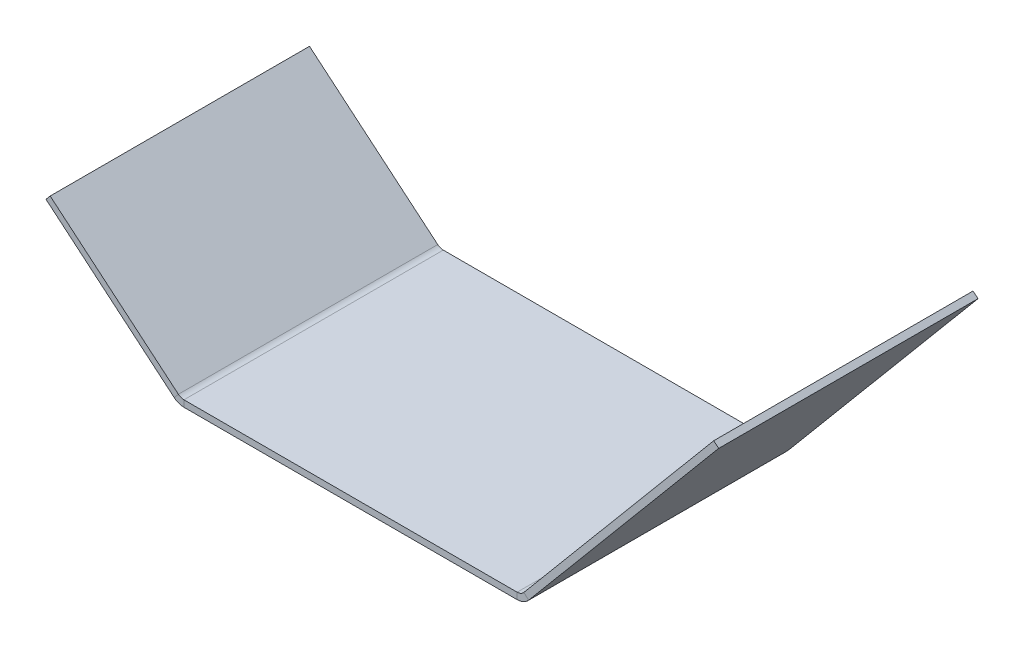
ISO-10303-21;
HEADER;
FILE_DESCRIPTION(('STEP AP214'),'2;1');
FILE_NAME('part.step','',(''),(''),'','','');
FILE_SCHEMA(('AUTOMOTIVE_DESIGN { 1 0 10303 214 1 1 1 1 }'));
ENDSEC;
DATA;
#1=APPLICATION_CONTEXT('core data for automotive mechanical design processes');
#2=APPLICATION_PROTOCOL_DEFINITION('international standard','automotive_design',2000,#1);
#3=PRODUCT_CONTEXT('',#1,'mechanical');
#4=PRODUCT('Part','Part','',(#3));
#5=PRODUCT_RELATED_PRODUCT_CATEGORY('part','',(#4));
#6=PRODUCT_DEFINITION_FORMATION('','',#4);
#7=PRODUCT_DEFINITION_CONTEXT('part definition',#1,'design');
#8=PRODUCT_DEFINITION('design','',#6,#7);
#9=PRODUCT_DEFINITION_SHAPE('','',#8);
#10=(LENGTH_UNIT() NAMED_UNIT(*) SI_UNIT(.MILLI.,.METRE.));
#11=(NAMED_UNIT(*) PLANE_ANGLE_UNIT() SI_UNIT($,.RADIAN.));
#12=(NAMED_UNIT(*) SI_UNIT($,.STERADIAN.) SOLID_ANGLE_UNIT());
#13=UNCERTAINTY_MEASURE_WITH_UNIT(LENGTH_MEASURE(1.E-05),#10,'distance_accuracy_value','');
#14=(GEOMETRIC_REPRESENTATION_CONTEXT(3) GLOBAL_UNCERTAINTY_ASSIGNED_CONTEXT((#13)) GLOBAL_UNIT_ASSIGNED_CONTEXT((#10,
#11,#12)) REPRESENTATION_CONTEXT('',''));
#15=CARTESIAN_POINT('',(0.,0.,0.));
#16=DIRECTION('',(0.,0.,1.));
#17=DIRECTION('',(1.,0.,0.));
#18=AXIS2_PLACEMENT_3D('',#15,#16,#17);
#19=CARTESIAN_POINT('',(-0.975860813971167,0.818844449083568,60.));
#20=DIRECTION('',(0.,0.,1.));
#21=DIRECTION('',(1.,0.,0.));
#22=AXIS2_PLACEMENT_3D('',#19,#20,#21);
#23=PLANE('',#22);
#24=DIRECTION('',(0.642787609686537,0.76604444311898,0.));
#25=VECTOR('',#24,1.);
#26=CARTESIAN_POINT('',(-0.975860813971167,0.818844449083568,60.));
#27=LINE('',#26,#25);
#28=CARTESIAN_POINT('',(-0.975860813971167,0.818844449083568,60.));
#29=VERTEX_POINT('',#28);
#30=CARTESIAN_POINT('',(-0.0116793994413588,1.96791111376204,60.));
#31=VERTEX_POINT('',#30);
#32=EDGE_CURVE('E11',#29,#31,#27,.T.);
#33=ORIENTED_EDGE('',*,*,#32,.F.);
#34=CARTESIAN_POINT('',(1.27389581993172,3.5,60.));
#35=DIRECTION('',(0.,0.,-1.));
#36=DIRECTION('',(-1.,0.,0.));
#37=AXIS2_PLACEMENT_3D('',#34,#35,#36);
#38=CIRCLE('',#37,3.5);
#39=CARTESIAN_POINT('',(1.27389581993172,0.,60.));
#40=VERTEX_POINT('',#39);
#41=EDGE_CURVE('E147',#29,#40,#38,.F.);
#42=ORIENTED_EDGE('',*,*,#41,.T.);
#43=DIRECTION('',(0.,-1.,0.));
#44=VECTOR('',#43,1.);
#45=CARTESIAN_POINT('',(1.27389581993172,1.5,60.));
#46=LINE('',#45,#44);
#47=CARTESIAN_POINT('',(1.27389581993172,1.5,60.));
#48=VERTEX_POINT('',#47);
#49=EDGE_CURVE('E45',#48,#40,#46,.T.);
#50=ORIENTED_EDGE('',*,*,#49,.F.);
#51=CARTESIAN_POINT('',(1.27389581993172,3.5,60.));
#52=DIRECTION('',(0.,0.,1.));
#53=DIRECTION('',(1.,0.,0.));
#54=AXIS2_PLACEMENT_3D('',#51,#52,#53);
#55=CIRCLE('',#54,2.);
#56=EDGE_CURVE('E241',#31,#48,#55,.T.);
#57=ORIENTED_EDGE('',*,*,#56,.F.);
#58=EDGE_LOOP('',(#33,#42,#50,#57));
#59=FACE_BOUND('',#58,.T.);
#60=ADVANCED_FACE('F37',(#59),#23,.T.);
#61=CARTESIAN_POINT('',(1.27389581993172,1.5,60.));
#62=DIRECTION('',(0.,0.,1.));
#63=DIRECTION('',(1.,0.,0.));
#64=AXIS2_PLACEMENT_3D('',#61,#62,#63);
#65=PLANE('',#64);
#66=DIRECTION('',(0.766044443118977,-0.64278760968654,0.));
#67=VECTOR('',#66,1.);
#68=CARTESIAN_POINT('',(-30.6417777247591,25.7115043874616,60.));
#69=LINE('',#68,#67);
#70=CARTESIAN_POINT('',(-30.6417777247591,25.7115043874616,60.));
#71=VERTEX_POINT('',#70);
#72=EDGE_CURVE('E152',#71,#29,#69,.T.);
#73=ORIENTED_EDGE('',*,*,#72,.T.);
#74=ORIENTED_EDGE('',*,*,#32,.T.);
#75=DIRECTION('',(0.766044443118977,-0.64278760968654,0.));
#76=VECTOR('',#75,1.);
#77=CARTESIAN_POINT('',(-29.6775963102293,26.8605710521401,60.));
#78=LINE('',#77,#76);
#79=CARTESIAN_POINT('',(-29.6775963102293,26.8605710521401,60.));
#80=VERTEX_POINT('',#79);
#81=EDGE_CURVE('E254',#80,#31,#78,.T.);
#82=ORIENTED_EDGE('',*,*,#81,.F.);
#83=DIRECTION('',(0.642787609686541,0.766044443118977,0.));
#84=VECTOR('',#83,1.);
#85=CARTESIAN_POINT('',(-30.6417777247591,25.7115043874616,60.));
#86=LINE('',#85,#84);
#87=EDGE_CURVE('E256',#71,#80,#86,.T.);
#88=ORIENTED_EDGE('',*,*,#87,.F.);
#89=EDGE_LOOP('',(#73,#74,#82,#88));
#90=FACE_BOUND('',#89,.T.);
#91=ADVANCED_FACE('F267',(#90),#65,.T.);
#92=CARTESIAN_POINT('',(1.27389581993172,0.,0.));
#93=DIRECTION('',(0.,0.,-1.));
#94=DIRECTION('',(-1.,0.,0.));
#95=AXIS2_PLACEMENT_3D('',#92,#93,#94);
#96=PLANE('',#95);
#97=DIRECTION('',(0.,1.,0.));
#98=VECTOR('',#97,1.);
#99=CARTESIAN_POINT('',(1.27389581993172,0.,0.));
#100=LINE('',#99,#98);
#101=CARTESIAN_POINT('',(1.27389581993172,0.,0.));
#102=VERTEX_POINT('',#101);
#103=CARTESIAN_POINT('',(1.27389581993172,1.5,0.));
#104=VERTEX_POINT('',#103);
#105=EDGE_CURVE('E145',#102,#104,#100,.T.);
#106=ORIENTED_EDGE('',*,*,#105,.F.);
#107=CARTESIAN_POINT('',(1.27389581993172,3.5,0.));
#108=DIRECTION('',(0.,0.,-1.));
#109=DIRECTION('',(-1.,0.,0.));
#110=AXIS2_PLACEMENT_3D('',#107,#108,#109);
#111=CIRCLE('',#110,3.5);
#112=CARTESIAN_POINT('',(-0.975860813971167,0.818844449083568,0.));
#113=VERTEX_POINT('',#112);
#114=EDGE_CURVE('E159',#113,#102,#111,.F.);
#115=ORIENTED_EDGE('',*,*,#114,.F.);
#116=DIRECTION('',(-0.642787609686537,-0.76604444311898,0.));
#117=VECTOR('',#116,1.);
#118=CARTESIAN_POINT('',(-0.0116793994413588,1.96791111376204,0.));
#119=LINE('',#118,#117);
#120=CARTESIAN_POINT('',(-0.0116793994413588,1.96791111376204,0.));
#121=VERTEX_POINT('',#120);
#122=EDGE_CURVE('E232',#121,#113,#119,.T.);
#123=ORIENTED_EDGE('',*,*,#122,.F.);
#124=CARTESIAN_POINT('',(1.27389581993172,3.5,0.));
#125=DIRECTION('',(0.,0.,1.));
#126=DIRECTION('',(1.,0.,0.));
#127=AXIS2_PLACEMENT_3D('',#124,#125,#126);
#128=CIRCLE('',#127,2.);
#129=EDGE_CURVE('E186',#121,#104,#128,.T.);
#130=ORIENTED_EDGE('',*,*,#129,.T.);
#131=EDGE_LOOP('',(#106,#115,#123,#130));
#132=FACE_BOUND('',#131,.T.);
#133=ADVANCED_FACE('F246',(#132),#96,.T.);
#134=CARTESIAN_POINT('',(-0.0116793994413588,1.96791111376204,0.));
#135=DIRECTION('',(0.,0.,-1.));
#136=DIRECTION('',(-1.,0.,0.));
#137=AXIS2_PLACEMENT_3D('',#134,#135,#136);
#138=PLANE('',#137);
#139=DIRECTION('',(1.,0.,0.));
#140=VECTOR('',#139,1.);
#141=CARTESIAN_POINT('',(0.,0.,0.));
#142=LINE('',#141,#140);
#143=CARTESIAN_POINT('',(78.3679231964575,0.,0.));
#144=VERTEX_POINT('',#143);
#145=EDGE_CURVE('E199',#102,#144,#142,.T.);
#146=ORIENTED_EDGE('',*,*,#145,.F.);
#147=ORIENTED_EDGE('',*,*,#105,.T.);
#148=DIRECTION('',(1.,0.,0.));
#149=VECTOR('',#148,1.);
#150=CARTESIAN_POINT('',(0.,1.5,0.));
#151=LINE('',#150,#149);
#152=CARTESIAN_POINT('',(78.3679231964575,1.5,0.));
#153=VERTEX_POINT('',#152);
#154=EDGE_CURVE('E184',#104,#153,#151,.T.);
#155=ORIENTED_EDGE('',*,*,#154,.T.);
#156=DIRECTION('',(0.,-1.,0.));
#157=VECTOR('',#156,1.);
#158=CARTESIAN_POINT('',(78.3679231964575,1.5,0.));
#159=LINE('',#158,#157);
#160=EDGE_CURVE('E94',#153,#144,#159,.T.);
#161=ORIENTED_EDGE('',*,*,#160,.T.);
#162=EDGE_LOOP('',(#146,#147,#155,#161));
#163=FACE_BOUND('',#162,.T.);
#164=ADVANCED_FACE('F234',(#163),#138,.T.);
#165=CARTESIAN_POINT('',(78.3679231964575,0.,60.));
#166=DIRECTION('',(0.,0.,1.));
#167=DIRECTION('',(1.,0.,0.));
#168=AXIS2_PLACEMENT_3D('',#165,#166,#167);
#169=PLANE('',#168);
#170=DIRECTION('',(0.,1.,0.));
#171=VECTOR('',#170,1.);
#172=CARTESIAN_POINT('',(78.3679231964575,0.,60.));
#173=LINE('',#172,#171);
#174=CARTESIAN_POINT('',(78.3679231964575,0.,60.));
#175=VERTEX_POINT('',#174);
#176=CARTESIAN_POINT('',(78.3679231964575,1.5,60.));
#177=VERTEX_POINT('',#176);
#178=EDGE_CURVE('E230',#175,#177,#173,.T.);
#179=ORIENTED_EDGE('',*,*,#178,.F.);
#180=CARTESIAN_POINT('',(78.3679231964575,3.5,60.));
#181=DIRECTION('',(0.,0.,-1.));
#182=DIRECTION('',(-1.,0.,0.));
#183=AXIS2_PLACEMENT_3D('',#180,#181,#182);
#184=CIRCLE('',#183,3.5);
#185=CARTESIAN_POINT('',(81.0490787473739,1.25024336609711,60.));
#186=VERTEX_POINT('',#185);
#187=EDGE_CURVE('E167',#175,#186,#184,.F.);
#188=ORIENTED_EDGE('',*,*,#187,.T.);
#189=DIRECTION('',(0.766044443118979,-0.642787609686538,0.));
#190=VECTOR('',#189,1.);
#191=CARTESIAN_POINT('',(79.9000120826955,2.21442478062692,60.));
#192=LINE('',#191,#190);
#193=CARTESIAN_POINT('',(79.9000120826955,2.21442478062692,60.));
#194=VERTEX_POINT('',#193);
#195=EDGE_CURVE('E53',#194,#186,#192,.T.);
#196=ORIENTED_EDGE('',*,*,#195,.F.);
#197=CARTESIAN_POINT('',(78.3679231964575,3.5,60.));
#198=DIRECTION('',(0.,0.,1.));
#199=DIRECTION('',(1.,0.,0.));
#200=AXIS2_PLACEMENT_3D('',#197,#198,#199);
#201=CIRCLE('',#200,2.);
#202=EDGE_CURVE('E258',#177,#194,#201,.T.);
#203=ORIENTED_EDGE('',*,*,#202,.F.);
#204=EDGE_LOOP('',(#179,#188,#196,#203));
#205=FACE_BOUND('',#204,.T.);
#206=ADVANCED_FACE('F293',(#205),#169,.T.);
#207=CARTESIAN_POINT('',(79.9000120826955,2.21442478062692,60.));
#208=DIRECTION('',(0.,0.,1.));
#209=DIRECTION('',(1.,0.,0.));
#210=AXIS2_PLACEMENT_3D('',#207,#208,#209);
#211=PLANE('',#210);
#212=DIRECTION('',(1.,0.,0.));
#213=VECTOR('',#212,1.);
#214=CARTESIAN_POINT('',(0.,0.,60.));
#215=LINE('',#214,#213);
#216=EDGE_CURVE('E137',#40,#175,#215,.T.);
#217=ORIENTED_EDGE('',*,*,#216,.T.);
#218=ORIENTED_EDGE('',*,*,#178,.T.);
#219=DIRECTION('',(1.,0.,0.));
#220=VECTOR('',#219,1.);
#221=CARTESIAN_POINT('',(0.,1.5,60.));
#222=LINE('',#221,#220);
#223=EDGE_CURVE('E140',#48,#177,#222,.T.);
#224=ORIENTED_EDGE('',*,*,#223,.F.);
#225=ORIENTED_EDGE('',*,*,#49,.T.);
#226=EDGE_LOOP('',(#217,#218,#224,#225));
#227=FACE_BOUND('',#226,.T.);
#228=ADVANCED_FACE('F135',(#227),#211,.T.);
#229=CARTESIAN_POINT('',(81.0490787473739,1.25024336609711,0.));
#230=DIRECTION('',(0.,0.,-1.));
#231=DIRECTION('',(-1.,0.,0.));
#232=AXIS2_PLACEMENT_3D('',#229,#230,#231);
#233=PLANE('',#232);
#234=DIRECTION('',(-0.766044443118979,0.642787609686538,0.));
#235=VECTOR('',#234,1.);
#236=CARTESIAN_POINT('',(81.0490787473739,1.25024336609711,0.));
#237=LINE('',#236,#235);
#238=CARTESIAN_POINT('',(81.0490787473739,1.25024336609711,0.));
#239=VERTEX_POINT('',#238);
#240=CARTESIAN_POINT('',(79.9000120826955,2.21442478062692,0.));
#241=VERTEX_POINT('',#240);
#242=EDGE_CURVE('E101',#239,#241,#237,.T.);
#243=ORIENTED_EDGE('',*,*,#242,.F.);
#244=CARTESIAN_POINT('',(78.3679231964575,3.5,0.));
#245=DIRECTION('',(0.,0.,-1.));
#246=DIRECTION('',(-1.,0.,0.));
#247=AXIS2_PLACEMENT_3D('',#244,#245,#246);
#248=CIRCLE('',#247,3.5);
#249=EDGE_CURVE('E201',#144,#239,#248,.F.);
#250=ORIENTED_EDGE('',*,*,#249,.F.);
#251=ORIENTED_EDGE('',*,*,#160,.F.);
#252=CARTESIAN_POINT('',(78.3679231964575,3.5,0.));
#253=DIRECTION('',(0.,0.,1.));
#254=DIRECTION('',(1.,0.,0.));
#255=AXIS2_PLACEMENT_3D('',#252,#253,#254);
#256=CIRCLE('',#255,2.);
#257=EDGE_CURVE('E182',#153,#241,#256,.T.);
#258=ORIENTED_EDGE('',*,*,#257,.T.);
#259=EDGE_LOOP('',(#243,#250,#251,#258));
#260=FACE_BOUND('',#259,.T.);
#261=ADVANCED_FACE('F299',(#260),#233,.T.);
#262=CARTESIAN_POINT('',(78.3679231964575,1.5,0.));
#263=DIRECTION('',(0.,0.,-1.));
#264=DIRECTION('',(-1.,0.,0.));
#265=AXIS2_PLACEMENT_3D('',#262,#263,#264);
#266=PLANE('',#265);
#267=DIRECTION('',(0.642787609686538,0.766044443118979,0.));
#268=VECTOR('',#267,1.);
#269=CARTESIAN_POINT('',(80.,0.,0.));
#270=LINE('',#269,#268);
#271=CARTESIAN_POINT('',(124.995132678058,53.6231110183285,0.));
#272=VERTEX_POINT('',#271);
#273=EDGE_CURVE('E173',#239,#272,#270,.T.);
#274=ORIENTED_EDGE('',*,*,#273,.F.);
#275=ORIENTED_EDGE('',*,*,#242,.T.);
#276=DIRECTION('',(0.642787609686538,0.766044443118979,0.));
#277=VECTOR('',#276,1.);
#278=CARTESIAN_POINT('',(78.8509333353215,0.964181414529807,0.));
#279=LINE('',#278,#277);
#280=CARTESIAN_POINT('',(123.846066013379,54.5872924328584,0.));
#281=VERTEX_POINT('',#280);
#282=EDGE_CURVE('E179',#241,#281,#279,.T.);
#283=ORIENTED_EDGE('',*,*,#282,.T.);
#284=DIRECTION('',(0.766044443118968,-0.642787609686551,0.));
#285=VECTOR('',#284,1.);
#286=CARTESIAN_POINT('',(123.846066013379,54.5872924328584,0.));
#287=LINE('',#286,#285);
#288=EDGE_CURVE('E176',#281,#272,#287,.T.);
#289=ORIENTED_EDGE('',*,*,#288,.T.);
#290=EDGE_LOOP('',(#274,#275,#283,#289));
#291=FACE_BOUND('',#290,.T.);
#292=ADVANCED_FACE('F302',(#291),#266,.T.);
#293=CARTESIAN_POINT('',(80.,0.,60.));
#294=DIRECTION('',(-0.766044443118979,0.642787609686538,0.));
#295=DIRECTION('',(-0.642787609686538,-0.766044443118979,0.));
#296=AXIS2_PLACEMENT_3D('',#293,#294,#295);
#297=PLANE('',#296);
#298=ORIENTED_EDGE('',*,*,#273,.T.);
#299=DIRECTION('',(0.,0.,-1.));
#300=VECTOR('',#299,1.);
#301=CARTESIAN_POINT('',(124.995132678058,53.6231110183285,60.));
#302=LINE('',#301,#300);
#303=CARTESIAN_POINT('',(124.995132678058,53.6231110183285,60.));
#304=VERTEX_POINT('',#303);
#305=EDGE_CURVE('E225',#304,#272,#302,.T.);
#306=ORIENTED_EDGE('',*,*,#305,.F.);
#307=DIRECTION('',(0.642787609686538,0.766044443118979,0.));
#308=VECTOR('',#307,1.);
#309=CARTESIAN_POINT('',(80.,0.,60.));
#310=LINE('',#309,#308);
#311=EDGE_CURVE('E107',#186,#304,#310,.T.);
#312=ORIENTED_EDGE('',*,*,#311,.F.);
#313=DIRECTION('',(0.,0.,-1.));
#314=VECTOR('',#313,1.);
#315=CARTESIAN_POINT('',(81.0490787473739,1.25024336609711,60.));
#316=LINE('',#315,#314);
#317=EDGE_CURVE('E169',#186,#239,#316,.T.);
#318=ORIENTED_EDGE('',*,*,#317,.T.);
#319=EDGE_LOOP('',(#298,#306,#312,#318));
#320=FACE_BOUND('',#319,.T.);
#321=ADVANCED_FACE('F305',(#320),#297,.F.);
#322=CARTESIAN_POINT('',(123.846066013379,54.5872924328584,60.));
#323=DIRECTION('',(0.642787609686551,0.766044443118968,0.));
#324=DIRECTION('',(-0.766044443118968,0.642787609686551,0.));
#325=AXIS2_PLACEMENT_3D('',#322,#323,#324);
#326=PLANE('',#325);
#327=ORIENTED_EDGE('',*,*,#288,.F.);
#328=DIRECTION('',(0.,0.,-1.));
#329=VECTOR('',#328,1.);
#330=CARTESIAN_POINT('',(123.846066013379,54.5872924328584,60.));
#331=LINE('',#330,#329);
#332=CARTESIAN_POINT('',(123.846066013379,54.5872924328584,60.));
#333=VERTEX_POINT('',#332);
#334=EDGE_CURVE('E223',#333,#281,#331,.T.);
#335=ORIENTED_EDGE('',*,*,#334,.F.);
#336=DIRECTION('',(0.766044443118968,-0.642787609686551,0.));
#337=VECTOR('',#336,1.);
#338=CARTESIAN_POINT('',(123.846066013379,54.5872924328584,60.));
#339=LINE('',#338,#337);
#340=EDGE_CURVE('E513',#333,#304,#339,.T.);
#341=ORIENTED_EDGE('',*,*,#340,.T.);
#342=ORIENTED_EDGE('',*,*,#305,.T.);
#343=EDGE_LOOP('',(#327,#335,#341,#342));
#344=FACE_BOUND('',#343,.T.);
#345=ADVANCED_FACE('F309',(#344),#326,.T.);
#346=CARTESIAN_POINT('',(78.8509333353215,0.964181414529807,60.));
#347=DIRECTION('',(-0.766044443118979,0.642787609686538,0.));
#348=DIRECTION('',(-0.642787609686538,-0.766044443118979,0.));
#349=AXIS2_PLACEMENT_3D('',#346,#347,#348);
#350=PLANE('',#349);
#351=ORIENTED_EDGE('',*,*,#282,.F.);
#352=DIRECTION('',(0.,0.,-1.));
#353=VECTOR('',#352,1.);
#354=CARTESIAN_POINT('',(79.9000120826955,2.21442478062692,60.));
#355=LINE('',#354,#353);
#356=EDGE_CURVE('E220',#194,#241,#355,.T.);
#357=ORIENTED_EDGE('',*,*,#356,.F.);
#358=DIRECTION('',(0.642787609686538,0.766044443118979,0.));
#359=VECTOR('',#358,1.);
#360=CARTESIAN_POINT('',(78.8509333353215,0.964181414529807,60.));
#361=LINE('',#360,#359);
#362=EDGE_CURVE('E515',#194,#333,#361,.T.);
#363=ORIENTED_EDGE('',*,*,#362,.T.);
#364=ORIENTED_EDGE('',*,*,#334,.T.);
#365=EDGE_LOOP('',(#351,#357,#363,#364));
#366=FACE_BOUND('',#365,.T.);
#367=ADVANCED_FACE('F313',(#366),#350,.T.);
#368=CARTESIAN_POINT('',(78.3679231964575,3.5,60.));
#369=DIRECTION('',(0.,0.,-1.));
#370=DIRECTION('',(-1.,0.,0.));
#371=AXIS2_PLACEMENT_3D('',#368,#369,#370);
#372=CYLINDRICAL_SURFACE('',#371,2.);
#373=ORIENTED_EDGE('',*,*,#257,.F.);
#374=DIRECTION('',(0.,0.,-1.));
#375=VECTOR('',#374,1.);
#376=CARTESIAN_POINT('',(78.3679231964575,1.5,60.));
#377=LINE('',#376,#375);
#378=EDGE_CURVE('E217',#177,#153,#377,.T.);
#379=ORIENTED_EDGE('',*,*,#378,.F.);
#380=ORIENTED_EDGE('',*,*,#202,.T.);
#381=ORIENTED_EDGE('',*,*,#356,.T.);
#382=EDGE_LOOP('',(#373,#379,#380,#381));
#383=FACE_BOUND('',#382,.T.);
#384=ADVANCED_FACE('F317',(#383),#372,.F.);
#385=CARTESIAN_POINT('',(0.,1.5,60.));
#386=DIRECTION('',(0.,1.,0.));
#387=DIRECTION('',(0.,0.,1.));
#388=AXIS2_PLACEMENT_3D('',#385,#386,#387);
#389=PLANE('',#388);
#390=ORIENTED_EDGE('',*,*,#154,.F.);
#391=DIRECTION('',(0.,0.,-1.));
#392=VECTOR('',#391,1.);
#393=CARTESIAN_POINT('',(1.27389581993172,1.5,60.));
#394=LINE('',#393,#392);
#395=EDGE_CURVE('E214',#48,#104,#394,.T.);
#396=ORIENTED_EDGE('',*,*,#395,.F.);
#397=ORIENTED_EDGE('',*,*,#223,.T.);
#398=ORIENTED_EDGE('',*,*,#378,.T.);
#399=EDGE_LOOP('',(#390,#396,#397,#398));
#400=FACE_BOUND('',#399,.T.);
#401=ADVANCED_FACE('F243',(#400),#389,.T.);
#402=CARTESIAN_POINT('',(1.27389581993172,3.5,60.));
#403=DIRECTION('',(0.,0.,-1.));
#404=DIRECTION('',(-1.,0.,0.));
#405=AXIS2_PLACEMENT_3D('',#402,#403,#404);
#406=CYLINDRICAL_SURFACE('',#405,2.);
#407=ORIENTED_EDGE('',*,*,#129,.F.);
#408=DIRECTION('',(0.,0.,-1.));
#409=VECTOR('',#408,1.);
#410=CARTESIAN_POINT('',(-0.0116793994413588,1.96791111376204,60.));
#411=LINE('',#410,#409);
#412=EDGE_CURVE('E211',#31,#121,#411,.T.);
#413=ORIENTED_EDGE('',*,*,#412,.F.);
#414=ORIENTED_EDGE('',*,*,#56,.T.);
#415=ORIENTED_EDGE('',*,*,#395,.T.);
#416=EDGE_LOOP('',(#407,#413,#414,#415));
#417=FACE_BOUND('',#416,.T.);
#418=ADVANCED_FACE('F239',(#417),#406,.F.);
#419=CARTESIAN_POINT('',(-29.6775963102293,26.8605710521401,60.));
#420=DIRECTION('',(0.64278760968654,0.766044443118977,0.));
#421=DIRECTION('',(-0.766044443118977,0.64278760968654,0.));
#422=AXIS2_PLACEMENT_3D('',#419,#420,#421);
#423=PLANE('',#422);
#424=DIRECTION('',(0.766044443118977,-0.64278760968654,0.));
#425=VECTOR('',#424,1.);
#426=CARTESIAN_POINT('',(-29.6775963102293,26.8605710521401,0.));
#427=LINE('',#426,#425);
#428=CARTESIAN_POINT('',(-29.6775963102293,26.8605710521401,0.));
#429=VERTEX_POINT('',#428);
#430=EDGE_CURVE('E189',#429,#121,#427,.T.);
#431=ORIENTED_EDGE('',*,*,#430,.F.);
#432=DIRECTION('',(0.,0.,-1.));
#433=VECTOR('',#432,1.);
#434=CARTESIAN_POINT('',(-29.6775963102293,26.8605710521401,60.));
#435=LINE('',#434,#433);
#436=EDGE_CURVE('E209',#80,#429,#435,.T.);
#437=ORIENTED_EDGE('',*,*,#436,.F.);
#438=ORIENTED_EDGE('',*,*,#81,.T.);
#439=ORIENTED_EDGE('',*,*,#412,.T.);
#440=EDGE_LOOP('',(#431,#437,#438,#439));
#441=FACE_BOUND('',#440,.T.);
#442=ADVANCED_FACE('F252',(#441),#423,.T.);
#443=CARTESIAN_POINT('',(-30.6417777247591,25.7115043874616,60.));
#444=DIRECTION('',(-0.766044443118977,0.642787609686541,0.));
#445=DIRECTION('',(-0.642787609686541,-0.766044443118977,0.));
#446=AXIS2_PLACEMENT_3D('',#443,#444,#445);
#447=PLANE('',#446);
#448=DIRECTION('',(0.642787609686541,0.766044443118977,0.));
#449=VECTOR('',#448,1.);
#450=CARTESIAN_POINT('',(-30.6417777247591,25.7115043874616,0.));
#451=LINE('',#450,#449);
#452=CARTESIAN_POINT('',(-30.6417777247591,25.7115043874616,0.));
#453=VERTEX_POINT('',#452);
#454=EDGE_CURVE('E192',#453,#429,#451,.T.);
#455=ORIENTED_EDGE('',*,*,#454,.F.);
#456=DIRECTION('',(0.,0.,-1.));
#457=VECTOR('',#456,1.);
#458=CARTESIAN_POINT('',(-30.6417777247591,25.7115043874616,60.));
#459=LINE('',#458,#457);
#460=EDGE_CURVE('E207',#71,#453,#459,.T.);
#461=ORIENTED_EDGE('',*,*,#460,.F.);
#462=ORIENTED_EDGE('',*,*,#87,.T.);
#463=ORIENTED_EDGE('',*,*,#436,.T.);
#464=EDGE_LOOP('',(#455,#461,#462,#463));
#465=FACE_BOUND('',#464,.T.);
#466=ADVANCED_FACE('F273',(#465),#447,.T.);
#467=CARTESIAN_POINT('',(-30.6417777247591,25.7115043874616,60.));
#468=DIRECTION('',(0.64278760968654,0.766044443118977,0.));
#469=DIRECTION('',(-0.766044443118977,0.64278760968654,0.));
#470=AXIS2_PLACEMENT_3D('',#467,#468,#469);
#471=PLANE('',#470);
#472=DIRECTION('',(0.766044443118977,-0.64278760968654,0.));
#473=VECTOR('',#472,1.);
#474=CARTESIAN_POINT('',(-30.6417777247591,25.7115043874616,0.));
#475=LINE('',#474,#473);
#476=EDGE_CURVE('E195',#453,#113,#475,.T.);
#477=ORIENTED_EDGE('',*,*,#476,.T.);
#478=DIRECTION('',(0.,0.,-1.));
#479=VECTOR('',#478,1.);
#480=CARTESIAN_POINT('',(-0.975860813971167,0.818844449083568,60.));
#481=LINE('',#480,#479);
#482=EDGE_CURVE('E161',#29,#113,#481,.T.);
#483=ORIENTED_EDGE('',*,*,#482,.F.);
#484=ORIENTED_EDGE('',*,*,#72,.F.);
#485=ORIENTED_EDGE('',*,*,#460,.T.);
#486=EDGE_LOOP('',(#477,#483,#484,#485));
#487=FACE_BOUND('',#486,.T.);
#488=ADVANCED_FACE('F269',(#487),#471,.F.);
#489=CARTESIAN_POINT('',(1.27389581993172,3.5,60.));
#490=DIRECTION('',(0.,0.,-1.));
#491=DIRECTION('',(-1.,0.,0.));
#492=AXIS2_PLACEMENT_3D('',#489,#490,#491);
#493=CYLINDRICAL_SURFACE('',#492,3.5);
#494=ORIENTED_EDGE('',*,*,#114,.T.);
#495=DIRECTION('',(0.,0.,-1.));
#496=VECTOR('',#495,1.);
#497=CARTESIAN_POINT('',(1.27389581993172,0.,60.));
#498=LINE('',#497,#496);
#499=EDGE_CURVE('E156',#40,#102,#498,.T.);
#500=ORIENTED_EDGE('',*,*,#499,.F.);
#501=ORIENTED_EDGE('',*,*,#41,.F.);
#502=ORIENTED_EDGE('',*,*,#482,.T.);
#503=EDGE_LOOP('',(#494,#500,#501,#502));
#504=FACE_BOUND('',#503,.T.);
#505=ADVANCED_FACE('F157',(#504),#493,.T.);
#506=CARTESIAN_POINT('',(0.,0.,60.));
#507=DIRECTION('',(0.,1.,0.));
#508=DIRECTION('',(0.,0.,1.));
#509=AXIS2_PLACEMENT_3D('',#506,#507,#508);
#510=PLANE('',#509);
#511=ORIENTED_EDGE('',*,*,#145,.T.);
#512=DIRECTION('',(0.,0.,-1.));
#513=VECTOR('',#512,1.);
#514=CARTESIAN_POINT('',(78.3679231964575,0.,60.));
#515=LINE('',#514,#513);
#516=EDGE_CURVE('E162',#175,#144,#515,.T.);
#517=ORIENTED_EDGE('',*,*,#516,.F.);
#518=ORIENTED_EDGE('',*,*,#216,.F.);
#519=ORIENTED_EDGE('',*,*,#499,.T.);
#520=EDGE_LOOP('',(#511,#517,#518,#519));
#521=FACE_BOUND('',#520,.T.);
#522=ADVANCED_FACE('F164',(#521),#510,.F.);
#523=CARTESIAN_POINT('',(78.3679231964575,3.5,60.));
#524=DIRECTION('',(0.,0.,-1.));
#525=DIRECTION('',(-1.,0.,0.));
#526=AXIS2_PLACEMENT_3D('',#523,#524,#525);
#527=CYLINDRICAL_SURFACE('',#526,3.5);
#528=ORIENTED_EDGE('',*,*,#249,.T.);
#529=ORIENTED_EDGE('',*,*,#317,.F.);
#530=ORIENTED_EDGE('',*,*,#187,.F.);
#531=ORIENTED_EDGE('',*,*,#516,.T.);
#532=EDGE_LOOP('',(#528,#529,#530,#531));
#533=FACE_BOUND('',#532,.T.);
#534=ADVANCED_FACE('F364',(#533),#527,.T.);
#535=CARTESIAN_POINT('',(78.3679231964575,3.5,60.));
#536=DIRECTION('',(0.,0.,1.));
#537=DIRECTION('',(1.,0.,0.));
#538=AXIS2_PLACEMENT_3D('',#535,#536,#537);
#539=PLANE('',#538);
#540=ORIENTED_EDGE('',*,*,#311,.T.);
#541=ORIENTED_EDGE('',*,*,#340,.F.);
#542=ORIENTED_EDGE('',*,*,#362,.F.);
#543=ORIENTED_EDGE('',*,*,#195,.T.);
#544=EDGE_LOOP('',(#540,#541,#542,#543));
#545=FACE_BOUND('',#544,.T.);
#546=ADVANCED_FACE('F374',(#545),#539,.T.);
#547=CARTESIAN_POINT('',(78.3679231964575,3.5,0.));
#548=DIRECTION('',(0.,0.,1.));
#549=DIRECTION('',(1.,0.,0.));
#550=AXIS2_PLACEMENT_3D('',#547,#548,#549);
#551=PLANE('',#550);
#552=ORIENTED_EDGE('',*,*,#430,.T.);
#553=ORIENTED_EDGE('',*,*,#122,.T.);
#554=ORIENTED_EDGE('',*,*,#476,.F.);
#555=ORIENTED_EDGE('',*,*,#454,.T.);
#556=EDGE_LOOP('',(#552,#553,#554,#555));
#557=FACE_BOUND('',#556,.T.);
#558=ADVANCED_FACE('F271',(#557),#551,.F.);
#559=CLOSED_SHELL('',(#60,#91,#133,#164,#206,#228,#261,#292,#321,#345,#367,#384,#401,#418,#442,
#466,#488,#505,#522,#534,#546,#558));
#560=MANIFOLD_SOLID_BREP('B2',#559);
#561=ADVANCED_BREP_SHAPE_REPRESENTATION('',(#18,#560),#14);
#562=SHAPE_DEFINITION_REPRESENTATION(#9,#561);
ENDSEC;
END-ISO-10303-21;
